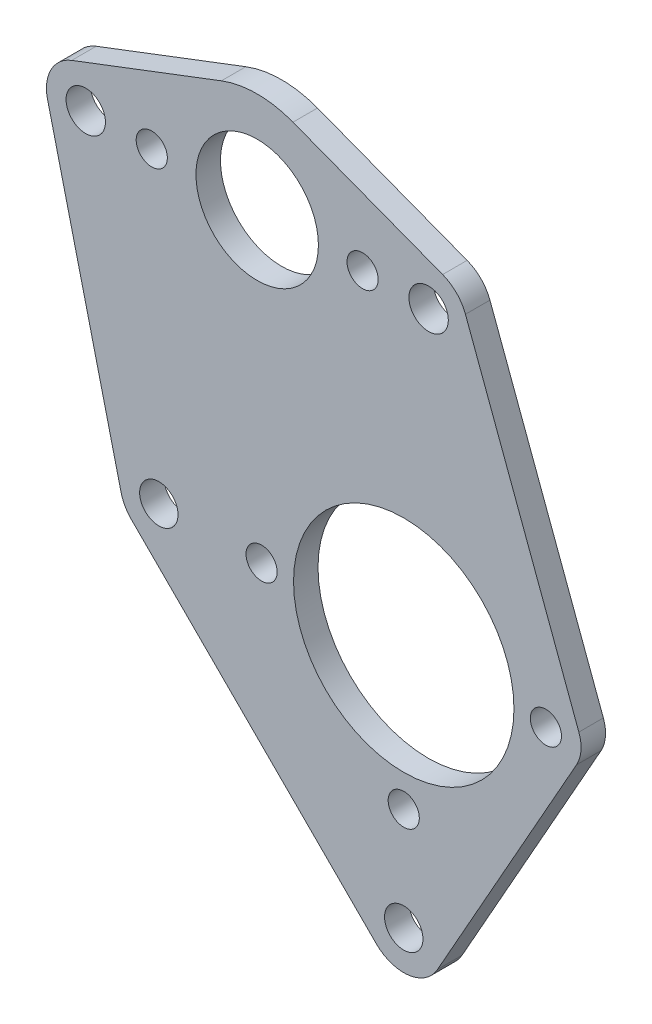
from build123d import *

# Parameters (mm, degrees)
SKETCH1_R           = 14.2875
SKETCH1_R_2         = 2.0193
SKETCH1_R_3         = 2.4892
SKETCH1_R_4         = 7.9375
SKETCH1_R_5         = 2.5527
BOSS_EXTRUDE1_DEPTH = 3.175


with BuildPart() as part:
    # Sketch1 → Boss-Extrude1 (new body)
    with BuildSketch(Plane.XY):
        with BuildLine():
            Line((-36.637762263, -1.184327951), (-46.173676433, 38.170718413))
            ThreePointArc((-46.173676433, 38.170718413), (-45.731389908, 41.740829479), (-43.040111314, 44.127946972))
            Line((-43.040111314, 44.127946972), (-23.640868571, 51.53183453))
            ThreePointArc((-23.640868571, 51.53183453), (-18.9992, 52.3875), (-14.357531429, 51.53183453))
            Line((-14.357531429, 51.53183453), (5.041711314, 44.127946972))
            ThreePointArc((5.041711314, 44.127946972), (6.84259039, 42.955306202), (7.999441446, 41.144243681))
            Line((7.999441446, 41.144243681), (22.70135905, 1.588412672))
            ThreePointArc((22.70135905, 1.588412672), (22.978842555, -0.272613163), (22.481189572, -2.08720837))
            ThreePointArc((22.481189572, -2.08720837), (22.441265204, -2.162986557), (22.399924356, -2.238001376))
            Line((22.399924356, -2.238001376), (4.381617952, -34.218658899))
            ThreePointArc((4.381617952, -34.218658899), (0.682651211, -36.732653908), (-3.556181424, -35.306181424))
            Line((-3.556181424, -35.306181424), (-35.306181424, -3.556181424))
            ThreePointArc((-35.306181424, -3.556181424), (-36.135369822, -2.461987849), (-36.637762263, -1.184327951))
        make_face()
        Circle(SKETCH1_R, mode=Mode.SUBTRACT)
        with Locations((18.4277, 0)):
            Circle(SKETCH1_R_2, mode=Mode.SUBTRACT)
        with Locations((-18.4277, 0)):
            Circle(SKETCH1_R_2, mode=Mode.SUBTRACT)
        with Locations((0, -18.4277)):
            Circle(SKETCH1_R_2, mode=Mode.SUBTRACT)
        with Locations((-31.75, 0)):
            Circle(SKETCH1_R_3, mode=Mode.SUBTRACT)
        with Locations((0, -31.75)):
            Circle(SKETCH1_R_3, mode=Mode.SUBTRACT)
        with Locations((-18.9992, 39.37)):
            Circle(SKETCH1_R_4, mode=Mode.SUBTRACT)
        with Locations((-41.2242, 39.37)):
            Circle(SKETCH1_R_5, mode=Mode.SUBTRACT)
        with Locations((3.2258, 39.37)):
            Circle(SKETCH1_R_5, mode=Mode.SUBTRACT)
        with Locations((-5.334, 39.37)):
            Circle(SKETCH1_R_2, mode=Mode.SUBTRACT)
        with Locations((-32.6644, 39.37)):
            Circle(SKETCH1_R_2, mode=Mode.SUBTRACT)
    extrude(amount=BOSS_EXTRUDE1_DEPTH)


solid = part.part
